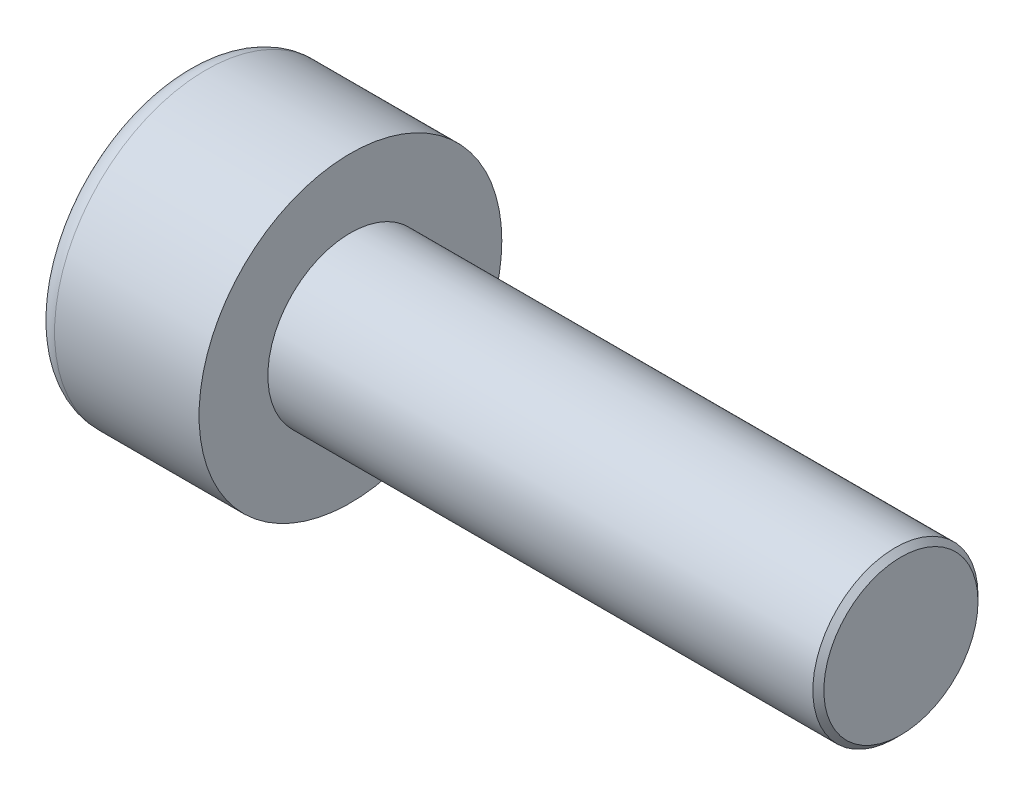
from build123d import *

# Parameters (mm, degrees)
SKETCH1_R           = 2.75
BASEHEAD_DEPTH      = 3
SKETCH2_R           = 1.5
BASEBODY_DEPTH      = 10
HEXAGONSOCKET_DEPTH = 1.3
TOPFILLET_R         = 0.375
CHAMFER1_SIZE       = 0.1


with BuildPart() as part:
    # Sketch1 → BaseHead (new body)
    with BuildSketch(Plane(origin=(0, 0, 0), x_dir=(0, 0, -1), z_dir=(1, 0, 0))):
        Circle(SKETCH1_R)
    extrude(amount=BASEHEAD_DEPTH)

    # Sketch2 → BaseBody (add)
    with BuildSketch(Plane(origin=(3, 0, 0), x_dir=(0, 0, -1), z_dir=(1, 0, 0))):
        Circle(SKETCH2_R)
    extrude(amount=BASEBODY_DEPTH)

    # Sketch3 → HexagonSocket (cut)
    with BuildSketch(Plane(origin=(0, 0, 0), x_dir=(0, 0, -1), z_dir=(1, 0, 0))):
        Polygon((1.443375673, 0), (0.721687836, 1.25), (-0.721687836, 1.25), (-1.443375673, 0), (-0.721687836, -1.25), (0.721687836, -1.25), align=None)
    extrude(amount=HEXAGONSOCKET_DEPTH, mode=Mode.SUBTRACT)

    # Sketch4 → Cut-Revolve1 (revolve, cut)
    with BuildSketch(Plane(origin=(-4.19613823, 0.75, 0), x_dir=(-1, 0, 0), z_dir=(0, 0, 1)), mode=Mode.PRIVATE) as cut_revolve1_sk:
        Polygon((-5.49613823, 2), (-6.217826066, 0.75), (-5.49613823, 0.75), align=None)
    revolve(cut_revolve1_sk.sketch.rotate(Axis((0.838992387, 0, 0), (-1, 0, 0)), 90), axis=Axis((0.838992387, 0, 0), (-1, 0, 0)), mode=Mode.SUBTRACT)

    # TopFillet
    topfillet_edges = [part.edges().sort_by_distance(p)[0] for p in [
        (0, 0, 2.75),
    ]]
    fillet(topfillet_edges, radius=TOPFILLET_R)

    # Chamfer1
    chamfer1_edges = [part.edges().sort_by_distance(p)[0] for p in [
        (13, 0, 1.5),
    ]]
    chamfer(chamfer1_edges, length=CHAMFER1_SIZE)


solid = part.part
